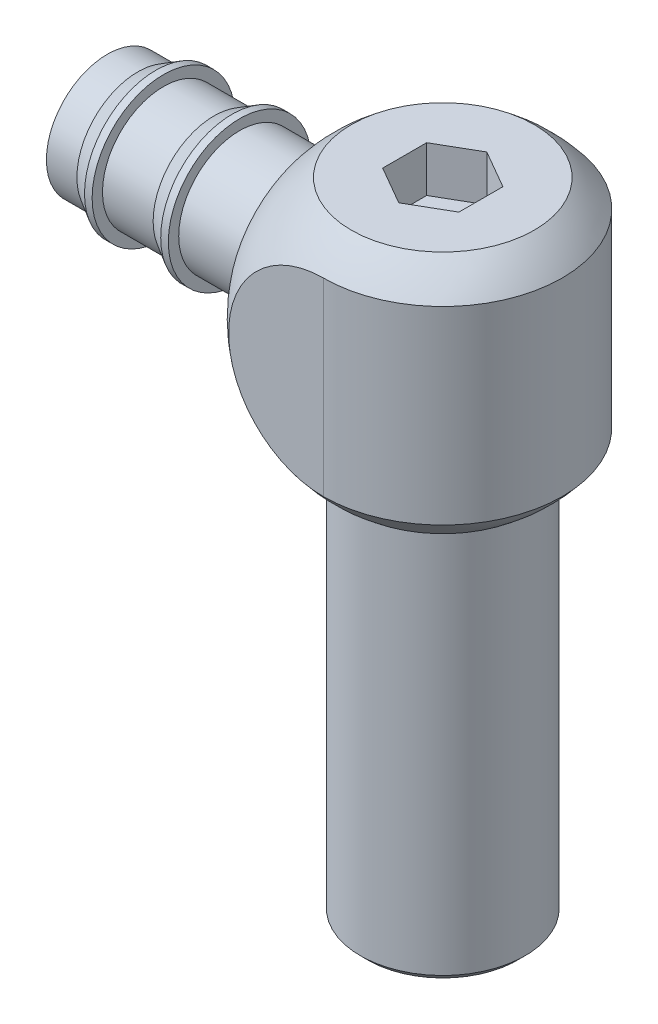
from build123d import *

# Parameters (mm, degrees)
CUT_EXTRUDE1_DEPTH      = 41.858377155
CUT_EXTRUDE1_DEPTH_BACK = 41.858377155
SKETCH3_OUTSIDE_W       = 44.748
SKETCH3_OUTSIDE_H       = 44.748
CUT_EXTRUDE2_DEPTH      = 39.408092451
CUT_EXTRUDE2_DEPTH_BACK = 39.408092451
SKETCH4_OUTSIDE_W       = 36.374
SKETCH4_OUTSIDE_H       = 43.232
SKETCH4_OUTSIDE_W_2     = 38.1
SKETCH4_OUTSIDE_H_2     = 25.4
FILLET1_R               = 1.5875
CUT_EXTRUDE3_START      = -34.925
SKETCH10_R              = 5.08
CUT_EXTRUDE3_DEPTH      = 34.925
CUT_EXTRUDE4_DEPTH      = 4.7625
SKETCH13_R              = 5.55625
CUT_EXTRUDE5_DEPTH      = 59.055


with BuildPart() as part:
    # Sketch1 → Revolve1 (revolve)
    with BuildSketch(Plane.XY):
        with BuildLine():
            Line((0, 34.1376), (0, 2.3876))
            ThreePointArc((0, 2.3876), (15.875, 18.2626), (0, 34.1376))
        make_face()
    revolve(axis=Axis((0, 0, 0), (0, 1, 0)))

    # Sketch3 outside → Cut-Extrude1 (cut, two sides: drawn at the far end of the back side and taken through both)
    with BuildSketch(Plane(origin=(0, 0, 0), x_dir=(1, 0, 0), z_dir=(0, 1, 0)).offset(-CUT_EXTRUDE1_DEPTH_BACK)):
        Rectangle(SKETCH3_OUTSIDE_W, SKETCH3_OUTSIDE_H)
        with BuildLine():
            Line((0, -12.446), (-12.446, -12.446))
            Line((-12.446, -12.446), (-12.446, 12.446))
            Line((-12.446, 12.446), (0, 12.446))
            ThreePointArc((0, 12.446), (12.446, 0), (0, -12.446))
        make_face(mode=Mode.SUBTRACT)
    extrude(amount=CUT_EXTRUDE1_DEPTH + CUT_EXTRUDE1_DEPTH_BACK, mode=Mode.SUBTRACT)

    # Sketch4 outside → Cut-Extrude2 (cut, two sides: drawn at the far end of the back side and taken through both)
    with BuildSketch(Plane.XY.offset(-CUT_EXTRUDE2_DEPTH_BACK)):
        with Locations((0, 18.263)):
            Rectangle(SKETCH4_OUTSIDE_W, SKETCH4_OUTSIDE_H)
        with Locations((0, 18.2626)):
            Rectangle(SKETCH4_OUTSIDE_W_2, SKETCH4_OUTSIDE_H_2, mode=Mode.SUBTRACT)
    extrude(amount=CUT_EXTRUDE2_DEPTH + CUT_EXTRUDE2_DEPTH_BACK, mode=Mode.SUBTRACT)

    # Sketch9 → Revolve2 (revolve)
    with BuildSketch(Plane(origin=(0, 18.2626, 0), x_dir=(1, 0, 0), z_dir=(0, 1, 0)), mode=Mode.PRIVATE) as revolve2_sk:
        Polygon((-34.925, 0), (-34.925, 6.35), (-31.75, 6.35), (-29.880251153, 7.4295), (-29.086501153, 7.4295), (-29.086501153, 6.35), (-23.8125, 6.35), (-21.942751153, 7.4295), (-21.149001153, 7.4295), (-21.149001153, 6.35), (0, 6.35), (0, 0), align=None)
    revolve(revolve2_sk.sketch.rotate(Axis((0, 18.2626, 0), (1, 0, 0)), 180), axis=Axis((0, 18.2626, 0), (1, 0, 0)))

    # Fillet1
    fillet1_edges = [part.edges().sort_by_distance(p)[0] for p in [
        (-12.446, 18.2626, -6.35),
    ]]
    fillet(fillet1_edges, radius=FILLET1_R)

    # Sketch10 → Cut-Extrude3 (cut)
    with BuildSketch(Plane.ZY.offset(34.925).offset(CUT_EXTRUDE3_START)):
        with Locations((0, 18.2626)):
            Circle(SKETCH10_R)
    extrude(amount=CUT_EXTRUDE3_DEPTH, mode=Mode.SUBTRACT)

    # Sketch11 → Revolve3 (revolve)
    with BuildSketch(Plane.XY, mode=Mode.PRIVATE) as revolve3_sk:
        Polygon((8.5725, 2.3876), (8.5725, 5.5626), (0, 5.5626), (0, -35.7124), (7.8105, -35.7124), (8.5725, -34.9504), align=None)
    revolve(revolve3_sk.sketch.rotate(Axis((0, -10.603393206, 0), (0, -1, 0)), 180), axis=Axis((0, -10.603393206, 0), (0, -1, 0)))

    # Sketch12 → Cut-Extrude4 (cut)
    with BuildSketch(Plane(origin=(0, 30.9626, 0), x_dir=(1, 0, 0), z_dir=(0, 1, 0))):
        Polygon((3.96875, 2.291358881), (0, 4.582717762), (-3.96875, 2.291358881), (-3.96875, -2.291358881), (0, -4.582717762), (3.96875, -2.291358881), align=None)
    extrude(amount=-CUT_EXTRUDE4_DEPTH, mode=Mode.SUBTRACT)

    # Sketch13 → Cut-Extrude5 (cut)
    with BuildSketch(Plane.XZ.offset(35.7124)):
        Circle(SKETCH13_R)
    extrude(amount=-CUT_EXTRUDE5_DEPTH, mode=Mode.SUBTRACT)


solid = part.part
